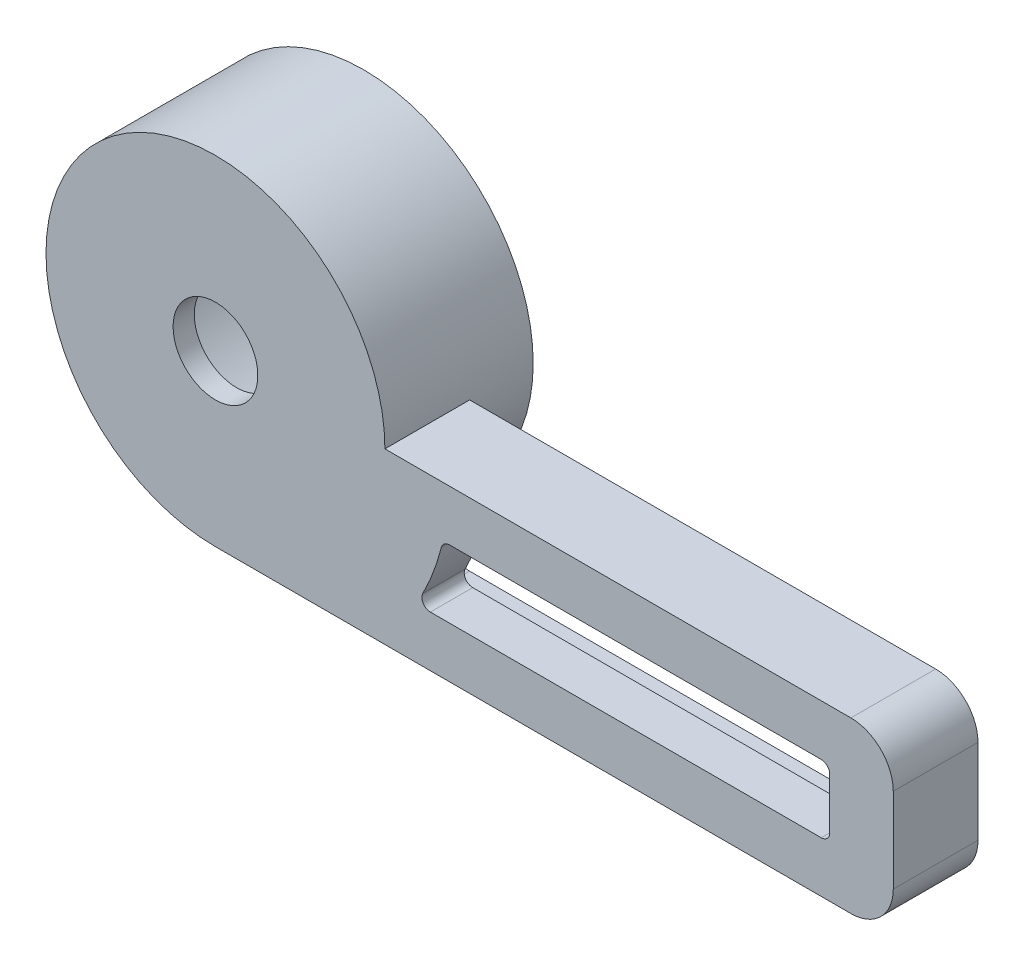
ISO-10303-21;
HEADER;
FILE_DESCRIPTION(('STEP AP214'),'2;1');
FILE_NAME('part.step','',(''),(''),'','','');
FILE_SCHEMA(('AUTOMOTIVE_DESIGN { 1 0 10303 214 1 1 1 1 }'));
ENDSEC;
DATA;
#1=APPLICATION_CONTEXT('core data for automotive mechanical design processes');
#2=APPLICATION_PROTOCOL_DEFINITION('international standard','automotive_design',2000,#1);
#3=PRODUCT_CONTEXT('',#1,'mechanical');
#4=PRODUCT('Part','Part','',(#3));
#5=PRODUCT_RELATED_PRODUCT_CATEGORY('part','',(#4));
#6=PRODUCT_DEFINITION_FORMATION('','',#4);
#7=PRODUCT_DEFINITION_CONTEXT('part definition',#1,'design');
#8=PRODUCT_DEFINITION('design','',#6,#7);
#9=PRODUCT_DEFINITION_SHAPE('','',#8);
#10=(LENGTH_UNIT() NAMED_UNIT(*) SI_UNIT(.MILLI.,.METRE.));
#11=(NAMED_UNIT(*) PLANE_ANGLE_UNIT() SI_UNIT($,.RADIAN.));
#12=(NAMED_UNIT(*) SI_UNIT($,.STERADIAN.) SOLID_ANGLE_UNIT());
#13=UNCERTAINTY_MEASURE_WITH_UNIT(LENGTH_MEASURE(1.E-05),#10,'distance_accuracy_value','');
#14=(GEOMETRIC_REPRESENTATION_CONTEXT(3) GLOBAL_UNCERTAINTY_ASSIGNED_CONTEXT((#13)) GLOBAL_UNIT_ASSIGNED_CONTEXT((#10,
#11,#12)) REPRESENTATION_CONTEXT('',''));
#15=CARTESIAN_POINT('',(0.,0.,0.));
#16=DIRECTION('',(0.,0.,1.));
#17=DIRECTION('',(1.,0.,0.));
#18=AXIS2_PLACEMENT_3D('',#15,#16,#17);
#19=CARTESIAN_POINT('',(-60.,20.,-20.));
#20=DIRECTION('',(0.,-1.,0.));
#21=DIRECTION('',(0.,0.,-1.));
#22=AXIS2_PLACEMENT_3D('',#19,#20,#21);
#23=PLANE('',#22);
#24=DIRECTION('',(1.,0.,0.));
#25=VECTOR('',#24,1.);
#26=CARTESIAN_POINT('',(-60.,20.,-20.));
#27=LINE('',#26,#25);
#28=CARTESIAN_POINT('',(-20.,20.,-20.));
#29=VERTEX_POINT('',#28);
#30=CARTESIAN_POINT('',(89.9999999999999,20.,-20.));
#31=VERTEX_POINT('',#30);
#32=EDGE_CURVE('E361',#29,#31,#27,.T.);
#33=ORIENTED_EDGE('',*,*,#32,.F.);
#34=DIRECTION('',(0.,0.,1.));
#35=VECTOR('',#34,1.);
#36=CARTESIAN_POINT('',(-20.,20.,-35.));
#37=LINE('',#36,#35);
#38=CARTESIAN_POINT('',(-20.,20.,0.));
#39=VERTEX_POINT('',#38);
#40=EDGE_CURVE('E337',#29,#39,#37,.T.);
#41=ORIENTED_EDGE('',*,*,#40,.T.);
#42=DIRECTION('',(1.,0.,0.));
#43=VECTOR('',#42,1.);
#44=CARTESIAN_POINT('',(-60.,20.,0.));
#45=LINE('',#44,#43);
#46=CARTESIAN_POINT('',(89.9999999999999,20.,0.));
#47=VERTEX_POINT('',#46);
#48=EDGE_CURVE('E349',#39,#47,#45,.T.);
#49=ORIENTED_EDGE('',*,*,#48,.T.);
#50=DIRECTION('',(0.,0.,1.));
#51=VECTOR('',#50,1.);
#52=CARTESIAN_POINT('',(89.9999999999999,20.,-20.));
#53=LINE('',#52,#51);
#54=EDGE_CURVE('E11',#31,#47,#53,.T.);
#55=ORIENTED_EDGE('',*,*,#54,.F.);
#56=EDGE_LOOP('',(#33,#41,#49,#55));
#57=FACE_BOUND('',#56,.T.);
#58=ADVANCED_FACE('F39',(#57),#23,.F.);
#59=CARTESIAN_POINT('',(90.,10.,-20.));
#60=DIRECTION('',(0.,0.,1.));
#61=DIRECTION('',(1.,0.,0.));
#62=AXIS2_PLACEMENT_3D('',#59,#60,#61);
#63=CYLINDRICAL_SURFACE('',#62,10.);
#64=CARTESIAN_POINT('',(90.,10.,0.));
#65=DIRECTION('',(0.,0.,-1.));
#66=DIRECTION('',(-1.,0.,0.));
#67=AXIS2_PLACEMENT_3D('',#64,#65,#66);
#68=CIRCLE('',#67,10.);
#69=CARTESIAN_POINT('',(100.,9.99999999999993,0.));
#70=VERTEX_POINT('',#69);
#71=EDGE_CURVE('E346',#47,#70,#68,.T.);
#72=ORIENTED_EDGE('',*,*,#71,.T.);
#73=DIRECTION('',(0.,0.,1.));
#74=VECTOR('',#73,1.);
#75=CARTESIAN_POINT('',(100.,9.99999999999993,-20.));
#76=LINE('',#75,#74);
#77=CARTESIAN_POINT('',(100.,9.99999999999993,-20.));
#78=VERTEX_POINT('',#77);
#79=EDGE_CURVE('E48',#78,#70,#76,.T.);
#80=ORIENTED_EDGE('',*,*,#79,.F.);
#81=CARTESIAN_POINT('',(90.,10.,-20.));
#82=DIRECTION('',(0.,0.,-1.));
#83=DIRECTION('',(-1.,0.,0.));
#84=AXIS2_PLACEMENT_3D('',#81,#82,#83);
#85=CIRCLE('',#84,10.);
#86=EDGE_CURVE('E359',#31,#78,#85,.T.);
#87=ORIENTED_EDGE('',*,*,#86,.F.);
#88=ORIENTED_EDGE('',*,*,#54,.T.);
#89=EDGE_LOOP('',(#72,#80,#87,#88));
#90=FACE_BOUND('',#89,.T.);
#91=ADVANCED_FACE('F386',(#90),#63,.T.);
#92=CARTESIAN_POINT('',(100.,-9.99999999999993,-20.));
#93=DIRECTION('',(1.,0.,0.));
#94=DIRECTION('',(0.,0.,-1.));
#95=AXIS2_PLACEMENT_3D('',#92,#93,#94);
#96=PLANE('',#95);
#97=DIRECTION('',(0.,1.,0.));
#98=VECTOR('',#97,1.);
#99=CARTESIAN_POINT('',(100.,-9.99999999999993,0.));
#100=LINE('',#99,#98);
#101=CARTESIAN_POINT('',(100.,-9.99999999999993,0.));
#102=VERTEX_POINT('',#101);
#103=EDGE_CURVE('E343',#102,#70,#100,.T.);
#104=ORIENTED_EDGE('',*,*,#103,.F.);
#105=DIRECTION('',(0.,0.,1.));
#106=VECTOR('',#105,1.);
#107=CARTESIAN_POINT('',(100.,-9.99999999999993,-20.));
#108=LINE('',#107,#106);
#109=CARTESIAN_POINT('',(100.,-9.99999999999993,-20.));
#110=VERTEX_POINT('',#109);
#111=EDGE_CURVE('E364',#110,#102,#108,.T.);
#112=ORIENTED_EDGE('',*,*,#111,.F.);
#113=DIRECTION('',(0.,1.,0.));
#114=VECTOR('',#113,1.);
#115=CARTESIAN_POINT('',(100.,-9.99999999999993,-20.));
#116=LINE('',#115,#114);
#117=EDGE_CURVE('E356',#110,#78,#116,.T.);
#118=ORIENTED_EDGE('',*,*,#117,.T.);
#119=ORIENTED_EDGE('',*,*,#79,.T.);
#120=EDGE_LOOP('',(#104,#112,#118,#119));
#121=FACE_BOUND('',#120,.T.);
#122=ADVANCED_FACE('F400',(#121),#96,.T.);
#123=CARTESIAN_POINT('',(90.,-10.,-20.));
#124=DIRECTION('',(0.,0.,1.));
#125=DIRECTION('',(1.,0.,0.));
#126=AXIS2_PLACEMENT_3D('',#123,#124,#125);
#127=CYLINDRICAL_SURFACE('',#126,10.);
#128=CARTESIAN_POINT('',(90.,-10.,0.));
#129=DIRECTION('',(0.,0.,-1.));
#130=DIRECTION('',(-1.,0.,0.));
#131=AXIS2_PLACEMENT_3D('',#128,#129,#130);
#132=CIRCLE('',#131,10.);
#133=CARTESIAN_POINT('',(89.9999999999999,-20.,0.));
#134=VERTEX_POINT('',#133);
#135=EDGE_CURVE('E341',#102,#134,#132,.T.);
#136=ORIENTED_EDGE('',*,*,#135,.T.);
#137=DIRECTION('',(0.,0.,1.));
#138=VECTOR('',#137,1.);
#139=CARTESIAN_POINT('',(89.9999999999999,-20.,-20.));
#140=LINE('',#139,#138);
#141=CARTESIAN_POINT('',(89.9999999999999,-20.,-20.));
#142=VERTEX_POINT('',#141);
#143=EDGE_CURVE('E365',#142,#134,#140,.T.);
#144=ORIENTED_EDGE('',*,*,#143,.F.);
#145=CARTESIAN_POINT('',(90.,-10.,-20.));
#146=DIRECTION('',(0.,0.,-1.));
#147=DIRECTION('',(-1.,0.,0.));
#148=AXIS2_PLACEMENT_3D('',#145,#146,#147);
#149=CIRCLE('',#148,10.);
#150=EDGE_CURVE('E354',#110,#142,#149,.T.);
#151=ORIENTED_EDGE('',*,*,#150,.F.);
#152=ORIENTED_EDGE('',*,*,#111,.T.);
#153=EDGE_LOOP('',(#136,#144,#151,#152));
#154=FACE_BOUND('',#153,.T.);
#155=ADVANCED_FACE('F393',(#154),#127,.T.);
#156=CARTESIAN_POINT('',(89.9999999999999,-20.,-20.));
#157=DIRECTION('',(0.,1.,0.));
#158=DIRECTION('',(0.,0.,1.));
#159=AXIS2_PLACEMENT_3D('',#156,#157,#158);
#160=PLANE('',#159);
#161=DIRECTION('',(-1.,0.,0.));
#162=VECTOR('',#161,1.);
#163=CARTESIAN_POINT('',(89.9999999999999,-20.,0.));
#164=LINE('',#163,#162);
#165=CARTESIAN_POINT('',(-60.,-20.,0.));
#166=VERTEX_POINT('',#165);
#167=EDGE_CURVE('E339',#134,#166,#164,.T.);
#168=ORIENTED_EDGE('',*,*,#167,.T.);
#169=DIRECTION('',(0.,0.,1.));
#170=VECTOR('',#169,1.);
#171=CARTESIAN_POINT('',(-60.,-20.,-20.));
#172=LINE('',#171,#170);
#173=CARTESIAN_POINT('',(-60.,-20.,-20.));
#174=VERTEX_POINT('',#173);
#175=EDGE_CURVE('E43',#174,#166,#172,.T.);
#176=ORIENTED_EDGE('',*,*,#175,.F.);
#177=DIRECTION('',(-1.,0.,0.));
#178=VECTOR('',#177,1.);
#179=CARTESIAN_POINT('',(89.9999999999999,-20.,-20.));
#180=LINE('',#179,#178);
#181=EDGE_CURVE('E351',#142,#174,#180,.T.);
#182=ORIENTED_EDGE('',*,*,#181,.F.);
#183=ORIENTED_EDGE('',*,*,#143,.T.);
#184=EDGE_LOOP('',(#168,#176,#182,#183));
#185=FACE_BOUND('',#184,.T.);
#186=ADVANCED_FACE('F41',(#185),#160,.F.);
#187=CARTESIAN_POINT('',(90.,-10.,-20.));
#188=DIRECTION('',(0.,0.,-1.));
#189=DIRECTION('',(-1.,0.,0.));
#190=AXIS2_PLACEMENT_3D('',#187,#188,#189);
#191=PLANE('',#190);
#192=CARTESIAN_POINT('',(90.,-10.,-20.));
#193=DIRECTION('',(0.,0.,-1.));
#194=DIRECTION('',(-1.,0.,0.));
#195=AXIS2_PLACEMENT_3D('',#192,#193,#194);
#196=CIRCLE('',#195,4.99999999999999);
#197=CARTESIAN_POINT('',(95.,-9.99999999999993,-20.));
#198=VERTEX_POINT('',#197);
#199=CARTESIAN_POINT('',(90.,-15.,-20.));
#200=VERTEX_POINT('',#199);
#201=EDGE_CURVE('E261',#198,#200,#196,.T.);
#202=ORIENTED_EDGE('',*,*,#201,.F.);
#203=DIRECTION('',(0.,1.,0.));
#204=VECTOR('',#203,1.);
#205=CARTESIAN_POINT('',(95.,-9.99999999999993,-20.));
#206=LINE('',#205,#204);
#207=CARTESIAN_POINT('',(95.,9.99999999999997,-20.));
#208=VERTEX_POINT('',#207);
#209=EDGE_CURVE('E281',#198,#208,#206,.T.);
#210=ORIENTED_EDGE('',*,*,#209,.T.);
#211=CARTESIAN_POINT('',(90.,10.,-20.));
#212=DIRECTION('',(0.,0.,-1.));
#213=DIRECTION('',(-1.,0.,0.));
#214=AXIS2_PLACEMENT_3D('',#211,#212,#213);
#215=CIRCLE('',#214,4.99999999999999);
#216=CARTESIAN_POINT('',(89.9999999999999,15.,-20.));
#217=VERTEX_POINT('',#216);
#218=EDGE_CURVE('E278',#217,#208,#215,.T.);
#219=ORIENTED_EDGE('',*,*,#218,.F.);
#220=DIRECTION('',(1.,0.,0.));
#221=VECTOR('',#220,1.);
#222=CARTESIAN_POINT('',(-11.0102051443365,15.,-20.));
#223=LINE('',#222,#221);
#224=CARTESIAN_POINT('',(-11.0102051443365,15.,-20.));
#225=VERTEX_POINT('',#224);
#226=EDGE_CURVE('E275',#225,#217,#223,.T.);
#227=ORIENTED_EDGE('',*,*,#226,.F.);
#228=CARTESIAN_POINT('',(-11.0102051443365,10.,-20.));
#229=DIRECTION('',(0.,0.,1.));
#230=DIRECTION('',(1.,0.,0.));
#231=AXIS2_PLACEMENT_3D('',#228,#229,#230);
#232=CIRCLE('',#231,5.);
#233=CARTESIAN_POINT('',(-15.9091846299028,11.,-20.));
#234=VERTEX_POINT('',#233);
#235=EDGE_CURVE('E272',#225,#234,#232,.T.);
#236=ORIENTED_EDGE('',*,*,#235,.T.);
#237=CARTESIAN_POINT('',(-60.,20.,-20.));
#238=DIRECTION('',(0.,0.,-1.));
#239=DIRECTION('',(-1.,0.,0.));
#240=AXIS2_PLACEMENT_3D('',#237,#238,#239);
#241=CIRCLE('',#240,45.);
#242=CARTESIAN_POINT('',(-24.,-7.,-20.));
#243=VERTEX_POINT('',#242);
#244=EDGE_CURVE('E269',#234,#243,#241,.T.);
#245=ORIENTED_EDGE('',*,*,#244,.T.);
#246=CARTESIAN_POINT('',(-20.,-10.,-20.));
#247=DIRECTION('',(0.,0.,1.));
#248=DIRECTION('',(1.,0.,0.));
#249=AXIS2_PLACEMENT_3D('',#246,#247,#248);
#250=CIRCLE('',#249,5.00000000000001);
#251=CARTESIAN_POINT('',(-20.,-15.,-20.));
#252=VERTEX_POINT('',#251);
#253=EDGE_CURVE('E266',#243,#252,#250,.T.);
#254=ORIENTED_EDGE('',*,*,#253,.T.);
#255=DIRECTION('',(-1.,0.,0.));
#256=VECTOR('',#255,1.);
#257=CARTESIAN_POINT('',(90.,-15.,-20.));
#258=LINE('',#257,#256);
#259=EDGE_CURVE('E263',#200,#252,#258,.T.);
#260=ORIENTED_EDGE('',*,*,#259,.F.);
#261=EDGE_LOOP('',(#202,#210,#219,#227,#236,#245,#254,#260));
#262=FACE_BOUND('',#261,.T.);
#263=CARTESIAN_POINT('',(-60.,20.,-20.));
#264=DIRECTION('',(0.,0.,-1.));
#265=DIRECTION('',(-1.,0.,0.));
#266=AXIS2_PLACEMENT_3D('',#263,#264,#265);
#267=CIRCLE('',#266,40.);
#268=EDGE_CURVE('E334',#29,#174,#267,.T.);
#269=ORIENTED_EDGE('',*,*,#268,.F.);
#270=ORIENTED_EDGE('',*,*,#32,.T.);
#271=ORIENTED_EDGE('',*,*,#86,.T.);
#272=ORIENTED_EDGE('',*,*,#117,.F.);
#273=ORIENTED_EDGE('',*,*,#150,.T.);
#274=ORIENTED_EDGE('',*,*,#181,.T.);
#275=EDGE_LOOP('',(#269,#270,#271,#272,#273,#274));
#276=FACE_BOUND('',#275,.T.);
#277=ADVANCED_FACE('F390',(#262,#276),#191,.T.);
#278=CARTESIAN_POINT('',(90.,-10.,0.));
#279=DIRECTION('',(0.,0.,-1.));
#280=DIRECTION('',(-1.,0.,0.));
#281=AXIS2_PLACEMENT_3D('',#278,#279,#280);
#282=PLANE('',#281);
#283=DIRECTION('',(0.,1.,0.));
#284=VECTOR('',#283,1.);
#285=CARTESIAN_POINT('',(85.,-5.99999999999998,0.));
#286=LINE('',#285,#284);
#287=CARTESIAN_POINT('',(85.,-5.99999999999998,0.));
#288=VERTEX_POINT('',#287);
#289=CARTESIAN_POINT('',(85.,5.99999999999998,0.));
#290=VERTEX_POINT('',#289);
#291=EDGE_CURVE('E241',#288,#290,#286,.T.);
#292=ORIENTED_EDGE('',*,*,#291,.F.);
#293=CARTESIAN_POINT('',(83.,-6.,0.));
#294=DIRECTION('',(0.,0.,-1.));
#295=DIRECTION('',(-1.,0.,0.));
#296=AXIS2_PLACEMENT_3D('',#293,#294,#295);
#297=CIRCLE('',#296,2.);
#298=CARTESIAN_POINT('',(83.,-8.,0.));
#299=VERTEX_POINT('',#298);
#300=EDGE_CURVE('E226',#288,#299,#297,.T.);
#301=ORIENTED_EDGE('',*,*,#300,.T.);
#302=DIRECTION('',(-1.,0.,0.));
#303=VECTOR('',#302,1.);
#304=CARTESIAN_POINT('',(83.,-8.,0.));
#305=LINE('',#304,#303);
#306=CARTESIAN_POINT('',(-9.27525258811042,-8.,0.));
#307=VERTEX_POINT('',#306);
#308=EDGE_CURVE('E229',#299,#307,#305,.T.);
#309=ORIENTED_EDGE('',*,*,#308,.T.);
#310=CARTESIAN_POINT('',(-9.27525258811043,-6.,0.));
#311=DIRECTION('',(0.,0.,1.));
#312=DIRECTION('',(1.,0.,0.));
#313=AXIS2_PLACEMENT_3D('',#310,#311,#312);
#314=CIRCLE('',#313,2.);
#315=CARTESIAN_POINT('',(-11.0550682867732,-5.0877192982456,0.));
#316=VERTEX_POINT('',#315);
#317=EDGE_CURVE('E196',#316,#307,#314,.T.);
#318=ORIENTED_EDGE('',*,*,#317,.F.);
#319=CARTESIAN_POINT('',(-60.,20.,0.));
#320=DIRECTION('',(0.,0.,-1.));
#321=DIRECTION('',(-1.,0.,0.));
#322=AXIS2_PLACEMENT_3D('',#319,#320,#321);
#323=CIRCLE('',#322,55.);
#324=CARTESIAN_POINT('',(-6.68477627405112,6.49122807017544,0.));
#325=VERTEX_POINT('',#324);
#326=EDGE_CURVE('E232',#325,#316,#323,.T.);
#327=ORIENTED_EDGE('',*,*,#326,.F.);
#328=CARTESIAN_POINT('',(-4.7460408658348,6.,0.));
#329=DIRECTION('',(0.,0.,1.));
#330=DIRECTION('',(1.,0.,0.));
#331=AXIS2_PLACEMENT_3D('',#328,#329,#330);
#332=CIRCLE('',#331,2.);
#333=CARTESIAN_POINT('',(-4.7460408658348,8.,0.));
#334=VERTEX_POINT('',#333);
#335=EDGE_CURVE('E234',#334,#325,#332,.T.);
#336=ORIENTED_EDGE('',*,*,#335,.F.);
#337=DIRECTION('',(1.,0.,0.));
#338=VECTOR('',#337,1.);
#339=CARTESIAN_POINT('',(-4.7460408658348,8.,0.));
#340=LINE('',#339,#338);
#341=CARTESIAN_POINT('',(83.,8.,0.));
#342=VERTEX_POINT('',#341);
#343=EDGE_CURVE('E236',#334,#342,#340,.T.);
#344=ORIENTED_EDGE('',*,*,#343,.T.);
#345=CARTESIAN_POINT('',(83.,6.,0.));
#346=DIRECTION('',(0.,0.,1.));
#347=DIRECTION('',(1.,0.,0.));
#348=AXIS2_PLACEMENT_3D('',#345,#346,#347);
#349=CIRCLE('',#348,2.);
#350=EDGE_CURVE('E239',#290,#342,#349,.T.);
#351=ORIENTED_EDGE('',*,*,#350,.F.);
#352=EDGE_LOOP('',(#292,#301,#309,#318,#327,#336,#344,#351));
#353=FACE_BOUND('',#352,.T.);
#354=CARTESIAN_POINT('',(-60.,20.,0.));
#355=DIRECTION('',(0.,0.,-1.));
#356=DIRECTION('',(-1.,0.,0.));
#357=AXIS2_PLACEMENT_3D('',#354,#355,#356);
#358=CIRCLE('',#357,10.);
#359=CARTESIAN_POINT('',(-70.,20.,0.));
#360=VERTEX_POINT('',#359);
#361=EDGE_CURVE('E258',#360,#360,#358,.T.);
#362=ORIENTED_EDGE('',*,*,#361,.T.);
#363=EDGE_LOOP('',(#362));
#364=FACE_BOUND('',#363,.T.);
#365=CARTESIAN_POINT('',(-60.,20.,0.));
#366=DIRECTION('',(0.,0.,1.));
#367=DIRECTION('',(1.,0.,0.));
#368=AXIS2_PLACEMENT_3D('',#365,#366,#367);
#369=CIRCLE('',#368,40.);
#370=EDGE_CURVE('E328',#39,#166,#369,.T.);
#371=ORIENTED_EDGE('',*,*,#370,.T.);
#372=ORIENTED_EDGE('',*,*,#167,.F.);
#373=ORIENTED_EDGE('',*,*,#135,.F.);
#374=ORIENTED_EDGE('',*,*,#103,.T.);
#375=ORIENTED_EDGE('',*,*,#71,.F.);
#376=ORIENTED_EDGE('',*,*,#48,.F.);
#377=EDGE_LOOP('',(#371,#372,#373,#374,#375,#376));
#378=FACE_BOUND('',#377,.T.);
#379=ADVANCED_FACE('F378',(#353,#364,#378),#282,.F.);
#380=CARTESIAN_POINT('',(-60.,20.,-35.));
#381=DIRECTION('',(0.,0.,1.));
#382=DIRECTION('',(1.,0.,0.));
#383=AXIS2_PLACEMENT_3D('',#380,#381,#382);
#384=CYLINDRICAL_SURFACE('',#383,40.);
#385=CARTESIAN_POINT('',(-60.,20.,-35.));
#386=DIRECTION('',(0.,0.,1.));
#387=DIRECTION('',(1.,0.,0.));
#388=AXIS2_PLACEMENT_3D('',#385,#386,#387);
#389=CIRCLE('',#388,40.);
#390=CARTESIAN_POINT('',(-20.,20.,-35.));
#391=VERTEX_POINT('',#390);
#392=EDGE_CURVE('E331',#391,#391,#389,.T.);
#393=ORIENTED_EDGE('',*,*,#392,.T.);
#394=EDGE_LOOP('',(#393));
#395=FACE_BOUND('',#394,.T.);
#396=ORIENTED_EDGE('',*,*,#40,.F.);
#397=ORIENTED_EDGE('',*,*,#268,.T.);
#398=ORIENTED_EDGE('',*,*,#175,.T.);
#399=ORIENTED_EDGE('',*,*,#370,.F.);
#400=EDGE_LOOP('',(#396,#397,#398,#399));
#401=FACE_BOUND('',#400,.T.);
#402=ADVANCED_FACE('F375',(#395,#401),#384,.T.);
#403=CARTESIAN_POINT('',(-60.,20.,-35.));
#404=DIRECTION('',(0.,0.,1.));
#405=DIRECTION('',(1.,0.,0.));
#406=AXIS2_PLACEMENT_3D('',#403,#404,#405);
#407=PLANE('',#406);
#408=CARTESIAN_POINT('',(-60.,20.,-35.));
#409=DIRECTION('',(0.,0.,-1.));
#410=DIRECTION('',(-1.,0.,0.));
#411=AXIS2_PLACEMENT_3D('',#408,#409,#410);
#412=CIRCLE('',#411,35.);
#413=CARTESIAN_POINT('',(-95.,20.,-35.));
#414=VERTEX_POINT('',#413);
#415=EDGE_CURVE('E307',#414,#414,#412,.T.);
#416=ORIENTED_EDGE('',*,*,#415,.F.);
#417=EDGE_LOOP('',(#416));
#418=FACE_BOUND('',#417,.T.);
#419=ORIENTED_EDGE('',*,*,#392,.F.);
#420=EDGE_LOOP('',(#419));
#421=FACE_BOUND('',#420,.T.);
#422=ADVANCED_FACE('F435',(#418,#421),#407,.F.);
#423=CARTESIAN_POINT('',(-60.,20.,-5.));
#424=DIRECTION('',(0.,0.,-1.));
#425=DIRECTION('',(-1.,0.,0.));
#426=AXIS2_PLACEMENT_3D('',#423,#424,#425);
#427=CYLINDRICAL_SURFACE('',#426,35.);
#428=CARTESIAN_POINT('',(-60.,20.,-5.));
#429=DIRECTION('',(0.,0.,-1.));
#430=DIRECTION('',(-1.,0.,0.));
#431=AXIS2_PLACEMENT_3D('',#428,#429,#430);
#432=CIRCLE('',#431,35.);
#433=CARTESIAN_POINT('',(-95.,20.,-5.));
#434=VERTEX_POINT('',#433);
#435=EDGE_CURVE('E325',#434,#434,#432,.T.);
#436=ORIENTED_EDGE('',*,*,#435,.F.);
#437=EDGE_LOOP('',(#436));
#438=FACE_BOUND('',#437,.T.);
#439=ORIENTED_EDGE('',*,*,#415,.T.);
#440=EDGE_LOOP('',(#439));
#441=FACE_BOUND('',#440,.T.);
#442=ADVANCED_FACE('F697',(#438,#441),#427,.F.);
#443=CARTESIAN_POINT('',(-60.,20.,-5.));
#444=DIRECTION('',(0.,0.,-1.));
#445=DIRECTION('',(-1.,0.,0.));
#446=AXIS2_PLACEMENT_3D('',#443,#444,#445);
#447=PLANE('',#446);
#448=CARTESIAN_POINT('',(-60.,20.,-5.));
#449=DIRECTION('',(0.,0.,-1.));
#450=DIRECTION('',(-1.,0.,0.));
#451=AXIS2_PLACEMENT_3D('',#448,#449,#450);
#452=CIRCLE('',#451,10.);
#453=CARTESIAN_POINT('',(-70.,20.,-5.));
#454=VERTEX_POINT('',#453);
#455=EDGE_CURVE('E245',#454,#454,#452,.T.);
#456=ORIENTED_EDGE('',*,*,#455,.F.);
#457=EDGE_LOOP('',(#456));
#458=FACE_BOUND('',#457,.T.);
#459=ORIENTED_EDGE('',*,*,#435,.T.);
#460=EDGE_LOOP('',(#459));
#461=FACE_BOUND('',#460,.T.);
#462=ADVANCED_FACE('F451',(#458,#461),#447,.T.);
#463=CARTESIAN_POINT('',(90.,-10.,-10.));
#464=DIRECTION('',(0.,0.,-1.));
#465=DIRECTION('',(-1.,0.,0.));
#466=AXIS2_PLACEMENT_3D('',#463,#464,#465);
#467=CYLINDRICAL_SURFACE('',#466,4.99999999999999);
#468=ORIENTED_EDGE('',*,*,#201,.T.);
#469=DIRECTION('',(0.,0.,-1.));
#470=VECTOR('',#469,1.);
#471=CARTESIAN_POINT('',(90.,-15.,-10.));
#472=LINE('',#471,#470);
#473=CARTESIAN_POINT('',(90.,-15.,-10.));
#474=VERTEX_POINT('',#473);
#475=EDGE_CURVE('E304',#474,#200,#472,.T.);
#476=ORIENTED_EDGE('',*,*,#475,.F.);
#477=CARTESIAN_POINT('',(90.,-10.,-10.));
#478=DIRECTION('',(0.,0.,-1.));
#479=DIRECTION('',(-1.,0.,0.));
#480=AXIS2_PLACEMENT_3D('',#477,#478,#479);
#481=CIRCLE('',#480,4.99999999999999);
#482=CARTESIAN_POINT('',(95.,-9.99999999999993,-10.));
#483=VERTEX_POINT('',#482);
#484=EDGE_CURVE('E284',#483,#474,#481,.T.);
#485=ORIENTED_EDGE('',*,*,#484,.F.);
#486=DIRECTION('',(0.,0.,-1.));
#487=VECTOR('',#486,1.);
#488=CARTESIAN_POINT('',(95.,-9.99999999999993,-10.));
#489=LINE('',#488,#487);
#490=EDGE_CURVE('E305',#483,#198,#489,.T.);
#491=ORIENTED_EDGE('',*,*,#490,.T.);
#492=EDGE_LOOP('',(#468,#476,#485,#491));
#493=FACE_BOUND('',#492,.T.);
#494=ADVANCED_FACE('F445',(#493),#467,.F.);
#495=CARTESIAN_POINT('',(95.,-9.99999999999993,-10.));
#496=DIRECTION('',(-1.,0.,0.));
#497=DIRECTION('',(0.,0.,1.));
#498=AXIS2_PLACEMENT_3D('',#495,#496,#497);
#499=PLANE('',#498);
#500=ORIENTED_EDGE('',*,*,#209,.F.);
#501=ORIENTED_EDGE('',*,*,#490,.F.);
#502=DIRECTION('',(0.,1.,0.));
#503=VECTOR('',#502,1.);
#504=CARTESIAN_POINT('',(95.,-9.99999999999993,-10.));
#505=LINE('',#504,#503);
#506=CARTESIAN_POINT('',(95.,9.99999999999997,-10.));
#507=VERTEX_POINT('',#506);
#508=EDGE_CURVE('E302',#483,#507,#505,.T.);
#509=ORIENTED_EDGE('',*,*,#508,.T.);
#510=DIRECTION('',(0.,0.,-1.));
#511=VECTOR('',#510,1.);
#512=CARTESIAN_POINT('',(95.,9.99999999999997,-10.));
#513=LINE('',#512,#511);
#514=EDGE_CURVE('E308',#507,#208,#513,.T.);
#515=ORIENTED_EDGE('',*,*,#514,.T.);
#516=EDGE_LOOP('',(#500,#501,#509,#515));
#517=FACE_BOUND('',#516,.T.);
#518=ADVANCED_FACE('F450',(#517),#499,.T.);
#519=CARTESIAN_POINT('',(90.,10.,-10.));
#520=DIRECTION('',(0.,0.,-1.));
#521=DIRECTION('',(-1.,0.,0.));
#522=AXIS2_PLACEMENT_3D('',#519,#520,#521);
#523=CYLINDRICAL_SURFACE('',#522,4.99999999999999);
#524=ORIENTED_EDGE('',*,*,#218,.T.);
#525=ORIENTED_EDGE('',*,*,#514,.F.);
#526=CARTESIAN_POINT('',(90.,10.,-10.));
#527=DIRECTION('',(0.,0.,-1.));
#528=DIRECTION('',(-1.,0.,0.));
#529=AXIS2_PLACEMENT_3D('',#526,#527,#528);
#530=CIRCLE('',#529,4.99999999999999);
#531=CARTESIAN_POINT('',(89.9999999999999,15.,-10.));
#532=VERTEX_POINT('',#531);
#533=EDGE_CURVE('E299',#532,#507,#530,.T.);
#534=ORIENTED_EDGE('',*,*,#533,.F.);
#535=DIRECTION('',(0.,0.,-1.));
#536=VECTOR('',#535,1.);
#537=CARTESIAN_POINT('',(89.9999999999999,15.,-10.));
#538=LINE('',#537,#536);
#539=EDGE_CURVE('E310',#532,#217,#538,.T.);
#540=ORIENTED_EDGE('',*,*,#539,.T.);
#541=EDGE_LOOP('',(#524,#525,#534,#540));
#542=FACE_BOUND('',#541,.T.);
#543=ADVANCED_FACE('F463',(#542),#523,.F.);
#544=CARTESIAN_POINT('',(-11.0102051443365,15.,-10.));
#545=DIRECTION('',(0.,1.,0.));
#546=DIRECTION('',(0.,0.,1.));
#547=AXIS2_PLACEMENT_3D('',#544,#545,#546);
#548=PLANE('',#547);
#549=ORIENTED_EDGE('',*,*,#226,.T.);
#550=ORIENTED_EDGE('',*,*,#539,.F.);
#551=DIRECTION('',(1.,0.,0.));
#552=VECTOR('',#551,1.);
#553=CARTESIAN_POINT('',(-11.0102051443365,15.,-10.));
#554=LINE('',#553,#552);
#555=CARTESIAN_POINT('',(-11.0102051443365,15.,-10.));
#556=VERTEX_POINT('',#555);
#557=EDGE_CURVE('E296',#556,#532,#554,.T.);
#558=ORIENTED_EDGE('',*,*,#557,.F.);
#559=DIRECTION('',(0.,0.,-1.));
#560=VECTOR('',#559,1.);
#561=CARTESIAN_POINT('',(-11.0102051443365,15.,-10.));
#562=LINE('',#561,#560);
#563=EDGE_CURVE('E312',#556,#225,#562,.T.);
#564=ORIENTED_EDGE('',*,*,#563,.T.);
#565=EDGE_LOOP('',(#549,#550,#558,#564));
#566=FACE_BOUND('',#565,.T.);
#567=ADVANCED_FACE('F473',(#566),#548,.F.);
#568=CARTESIAN_POINT('',(-11.0102051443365,10.,-10.));
#569=DIRECTION('',(0.,0.,-1.));
#570=DIRECTION('',(-1.,0.,0.));
#571=AXIS2_PLACEMENT_3D('',#568,#569,#570);
#572=CYLINDRICAL_SURFACE('',#571,5.);
#573=ORIENTED_EDGE('',*,*,#235,.F.);
#574=ORIENTED_EDGE('',*,*,#563,.F.);
#575=CARTESIAN_POINT('',(-11.0102051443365,10.,-10.));
#576=DIRECTION('',(0.,0.,1.));
#577=DIRECTION('',(1.,0.,0.));
#578=AXIS2_PLACEMENT_3D('',#575,#576,#577);
#579=CIRCLE('',#578,5.);
#580=CARTESIAN_POINT('',(-15.9091846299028,11.,-10.));
#581=VERTEX_POINT('',#580);
#582=EDGE_CURVE('E294',#556,#581,#579,.T.);
#583=ORIENTED_EDGE('',*,*,#582,.T.);
#584=DIRECTION('',(0.,0.,-1.));
#585=VECTOR('',#584,1.);
#586=CARTESIAN_POINT('',(-15.9091846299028,11.,-10.));
#587=LINE('',#586,#585);
#588=EDGE_CURVE('E314',#581,#234,#587,.T.);
#589=ORIENTED_EDGE('',*,*,#588,.T.);
#590=EDGE_LOOP('',(#573,#574,#583,#589));
#591=FACE_BOUND('',#590,.T.);
#592=ADVANCED_FACE('F483',(#591),#572,.F.);
#593=CARTESIAN_POINT('',(-60.,20.,-10.));
#594=DIRECTION('',(0.,0.,-1.));
#595=DIRECTION('',(-1.,0.,0.));
#596=AXIS2_PLACEMENT_3D('',#593,#594,#595);
#597=CYLINDRICAL_SURFACE('',#596,45.);
#598=ORIENTED_EDGE('',*,*,#244,.F.);
#599=ORIENTED_EDGE('',*,*,#588,.F.);
#600=CARTESIAN_POINT('',(-60.,20.,-10.));
#601=DIRECTION('',(0.,0.,-1.));
#602=DIRECTION('',(-1.,0.,0.));
#603=AXIS2_PLACEMENT_3D('',#600,#601,#602);
#604=CIRCLE('',#603,45.);
#605=CARTESIAN_POINT('',(-24.,-7.,-10.));
#606=VERTEX_POINT('',#605);
#607=EDGE_CURVE('E292',#581,#606,#604,.T.);
#608=ORIENTED_EDGE('',*,*,#607,.T.);
#609=DIRECTION('',(0.,0.,-1.));
#610=VECTOR('',#609,1.);
#611=CARTESIAN_POINT('',(-24.,-7.,-10.));
#612=LINE('',#611,#610);
#613=EDGE_CURVE('E316',#606,#243,#612,.T.);
#614=ORIENTED_EDGE('',*,*,#613,.T.);
#615=EDGE_LOOP('',(#598,#599,#608,#614));
#616=FACE_BOUND('',#615,.T.);
#617=ADVANCED_FACE('F493',(#616),#597,.T.);
#618=CARTESIAN_POINT('',(-20.,-10.,-10.));
#619=DIRECTION('',(0.,0.,-1.));
#620=DIRECTION('',(-1.,0.,0.));
#621=AXIS2_PLACEMENT_3D('',#618,#619,#620);
#622=CYLINDRICAL_SURFACE('',#621,5.00000000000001);
#623=ORIENTED_EDGE('',*,*,#253,.F.);
#624=ORIENTED_EDGE('',*,*,#613,.F.);
#625=CARTESIAN_POINT('',(-20.,-10.,-10.));
#626=DIRECTION('',(0.,0.,1.));
#627=DIRECTION('',(1.,0.,0.));
#628=AXIS2_PLACEMENT_3D('',#625,#626,#627);
#629=CIRCLE('',#628,5.00000000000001);
#630=CARTESIAN_POINT('',(-20.,-15.,-10.));
#631=VERTEX_POINT('',#630);
#632=EDGE_CURVE('E290',#606,#631,#629,.T.);
#633=ORIENTED_EDGE('',*,*,#632,.T.);
#634=DIRECTION('',(0.,0.,-1.));
#635=VECTOR('',#634,1.);
#636=CARTESIAN_POINT('',(-20.,-15.,-10.));
#637=LINE('',#636,#635);
#638=EDGE_CURVE('E318',#631,#252,#637,.T.);
#639=ORIENTED_EDGE('',*,*,#638,.T.);
#640=EDGE_LOOP('',(#623,#624,#633,#639));
#641=FACE_BOUND('',#640,.T.);
#642=ADVANCED_FACE('F503',(#641),#622,.F.);
#643=CARTESIAN_POINT('',(90.,-15.,-10.));
#644=DIRECTION('',(0.,-1.,0.));
#645=DIRECTION('',(1.,0.,0.));
#646=AXIS2_PLACEMENT_3D('',#643,#644,#645);
#647=PLANE('',#646);
#648=ORIENTED_EDGE('',*,*,#259,.T.);
#649=ORIENTED_EDGE('',*,*,#638,.F.);
#650=DIRECTION('',(-1.,0.,0.));
#651=VECTOR('',#650,1.);
#652=CARTESIAN_POINT('',(90.,-15.,-10.));
#653=LINE('',#652,#651);
#654=EDGE_CURVE('E287',#474,#631,#653,.T.);
#655=ORIENTED_EDGE('',*,*,#654,.F.);
#656=ORIENTED_EDGE('',*,*,#475,.T.);
#657=EDGE_LOOP('',(#648,#649,#655,#656));
#658=FACE_BOUND('',#657,.T.);
#659=ADVANCED_FACE('F513',(#658),#647,.F.);
#660=CARTESIAN_POINT('',(90.,-10.,-10.));
#661=DIRECTION('',(0.,0.,-1.));
#662=DIRECTION('',(-1.,0.,0.));
#663=AXIS2_PLACEMENT_3D('',#660,#661,#662);
#664=PLANE('',#663);
#665=CARTESIAN_POINT('',(83.,-6.,-10.));
#666=DIRECTION('',(0.,0.,-1.));
#667=DIRECTION('',(-1.,0.,0.));
#668=AXIS2_PLACEMENT_3D('',#665,#666,#667);
#669=CIRCLE('',#668,2.);
#670=CARTESIAN_POINT('',(85.,-5.99999999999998,-10.));
#671=VERTEX_POINT('',#670);
#672=CARTESIAN_POINT('',(83.,-8.,-10.));
#673=VERTEX_POINT('',#672);
#674=EDGE_CURVE('E64',#671,#673,#669,.T.);
#675=ORIENTED_EDGE('',*,*,#674,.F.);
#676=DIRECTION('',(0.,1.,0.));
#677=VECTOR('',#676,1.);
#678=CARTESIAN_POINT('',(85.,-5.99999999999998,-10.));
#679=LINE('',#678,#677);
#680=CARTESIAN_POINT('',(85.,5.99999999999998,-10.));
#681=VERTEX_POINT('',#680);
#682=EDGE_CURVE('E223',#671,#681,#679,.T.);
#683=ORIENTED_EDGE('',*,*,#682,.T.);
#684=CARTESIAN_POINT('',(83.,6.,-10.));
#685=DIRECTION('',(0.,0.,1.));
#686=DIRECTION('',(1.,0.,0.));
#687=AXIS2_PLACEMENT_3D('',#684,#685,#686);
#688=CIRCLE('',#687,2.);
#689=CARTESIAN_POINT('',(83.,8.,-10.));
#690=VERTEX_POINT('',#689);
#691=EDGE_CURVE('E220',#681,#690,#688,.T.);
#692=ORIENTED_EDGE('',*,*,#691,.T.);
#693=DIRECTION('',(1.,0.,0.));
#694=VECTOR('',#693,1.);
#695=CARTESIAN_POINT('',(-4.7460408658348,8.,-10.));
#696=LINE('',#695,#694);
#697=CARTESIAN_POINT('',(-4.7460408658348,8.,-10.));
#698=VERTEX_POINT('',#697);
#699=EDGE_CURVE('E217',#698,#690,#696,.T.);
#700=ORIENTED_EDGE('',*,*,#699,.F.);
#701=CARTESIAN_POINT('',(-4.7460408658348,6.,-10.));
#702=DIRECTION('',(0.,0.,1.));
#703=DIRECTION('',(1.,0.,0.));
#704=AXIS2_PLACEMENT_3D('',#701,#702,#703);
#705=CIRCLE('',#704,2.);
#706=CARTESIAN_POINT('',(-6.68477627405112,6.49122807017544,-10.));
#707=VERTEX_POINT('',#706);
#708=EDGE_CURVE('E212',#698,#707,#705,.T.);
#709=ORIENTED_EDGE('',*,*,#708,.T.);
#710=CARTESIAN_POINT('',(-60.,20.,-10.));
#711=DIRECTION('',(0.,0.,-1.));
#712=DIRECTION('',(-1.,0.,0.));
#713=AXIS2_PLACEMENT_3D('',#710,#711,#712);
#714=CIRCLE('',#713,55.);
#715=CARTESIAN_POINT('',(-11.0550682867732,-5.0877192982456,-10.));
#716=VERTEX_POINT('',#715);
#717=EDGE_CURVE('E210',#707,#716,#714,.T.);
#718=ORIENTED_EDGE('',*,*,#717,.T.);
#719=CARTESIAN_POINT('',(-9.27525258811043,-6.,-10.));
#720=DIRECTION('',(0.,0.,1.));
#721=DIRECTION('',(1.,0.,0.));
#722=AXIS2_PLACEMENT_3D('',#719,#720,#721);
#723=CIRCLE('',#722,2.);
#724=CARTESIAN_POINT('',(-9.27525258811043,-8.,-10.));
#725=VERTEX_POINT('',#724);
#726=EDGE_CURVE('E193',#716,#725,#723,.T.);
#727=ORIENTED_EDGE('',*,*,#726,.T.);
#728=DIRECTION('',(-1.,0.,0.));
#729=VECTOR('',#728,1.);
#730=CARTESIAN_POINT('',(83.,-8.,-10.));
#731=LINE('',#730,#729);
#732=EDGE_CURVE('E202',#673,#725,#731,.T.);
#733=ORIENTED_EDGE('',*,*,#732,.F.);
#734=EDGE_LOOP('',(#675,#683,#692,#700,#709,#718,#727,#733));
#735=FACE_BOUND('',#734,.T.);
#736=ORIENTED_EDGE('',*,*,#484,.T.);
#737=ORIENTED_EDGE('',*,*,#654,.T.);
#738=ORIENTED_EDGE('',*,*,#632,.F.);
#739=ORIENTED_EDGE('',*,*,#607,.F.);
#740=ORIENTED_EDGE('',*,*,#582,.F.);
#741=ORIENTED_EDGE('',*,*,#557,.T.);
#742=ORIENTED_EDGE('',*,*,#533,.T.);
#743=ORIENTED_EDGE('',*,*,#508,.F.);
#744=EDGE_LOOP('',(#736,#737,#738,#739,#740,#741,#742,#743));
#745=FACE_BOUND('',#744,.T.);
#746=ADVANCED_FACE('F206',(#735,#745),#664,.T.);
#747=CARTESIAN_POINT('',(-60.,20.,0.));
#748=DIRECTION('',(0.,0.,-1.));
#749=DIRECTION('',(-1.,0.,0.));
#750=AXIS2_PLACEMENT_3D('',#747,#748,#749);
#751=CYLINDRICAL_SURFACE('',#750,10.);
#752=ORIENTED_EDGE('',*,*,#361,.F.);
#753=EDGE_LOOP('',(#752));
#754=FACE_BOUND('',#753,.T.);
#755=ORIENTED_EDGE('',*,*,#455,.T.);
#756=EDGE_LOOP('',(#755));
#757=FACE_BOUND('',#756,.T.);
#758=ADVANCED_FACE('F530',(#754,#757),#751,.F.);
#759=CARTESIAN_POINT('',(83.,-6.,0.));
#760=DIRECTION('',(0.,0.,-1.));
#761=DIRECTION('',(-1.,0.,0.));
#762=AXIS2_PLACEMENT_3D('',#759,#760,#761);
#763=CYLINDRICAL_SURFACE('',#762,2.);
#764=ORIENTED_EDGE('',*,*,#674,.T.);
#765=DIRECTION('',(0.,0.,-1.));
#766=VECTOR('',#765,1.);
#767=CARTESIAN_POINT('',(83.,-8.,0.));
#768=LINE('',#767,#766);
#769=EDGE_CURVE('E199',#299,#673,#768,.T.);
#770=ORIENTED_EDGE('',*,*,#769,.F.);
#771=ORIENTED_EDGE('',*,*,#300,.F.);
#772=DIRECTION('',(0.,0.,-1.));
#773=VECTOR('',#772,1.);
#774=CARTESIAN_POINT('',(85.,-5.99999999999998,0.));
#775=LINE('',#774,#773);
#776=EDGE_CURVE('E243',#288,#671,#775,.T.);
#777=ORIENTED_EDGE('',*,*,#776,.T.);
#778=EDGE_LOOP('',(#764,#770,#771,#777));
#779=FACE_BOUND('',#778,.T.);
#780=ADVANCED_FACE('F536',(#779),#763,.F.);
#781=CARTESIAN_POINT('',(85.,-5.99999999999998,0.));
#782=DIRECTION('',(-1.,0.,0.));
#783=DIRECTION('',(0.,-1.,0.));
#784=AXIS2_PLACEMENT_3D('',#781,#782,#783);
#785=PLANE('',#784);
#786=ORIENTED_EDGE('',*,*,#682,.F.);
#787=ORIENTED_EDGE('',*,*,#776,.F.);
#788=ORIENTED_EDGE('',*,*,#291,.T.);
#789=DIRECTION('',(0.,0.,-1.));
#790=VECTOR('',#789,1.);
#791=CARTESIAN_POINT('',(85.,5.99999999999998,0.));
#792=LINE('',#791,#790);
#793=EDGE_CURVE('E246',#290,#681,#792,.T.);
#794=ORIENTED_EDGE('',*,*,#793,.T.);
#795=EDGE_LOOP('',(#786,#787,#788,#794));
#796=FACE_BOUND('',#795,.T.);
#797=ADVANCED_FACE('F546',(#796),#785,.T.);
#798=CARTESIAN_POINT('',(83.,6.,0.));
#799=DIRECTION('',(0.,0.,-1.));
#800=DIRECTION('',(-1.,0.,0.));
#801=AXIS2_PLACEMENT_3D('',#798,#799,#800);
#802=CYLINDRICAL_SURFACE('',#801,2.);
#803=ORIENTED_EDGE('',*,*,#691,.F.);
#804=ORIENTED_EDGE('',*,*,#793,.F.);
#805=ORIENTED_EDGE('',*,*,#350,.T.);
#806=DIRECTION('',(0.,0.,-1.));
#807=VECTOR('',#806,1.);
#808=CARTESIAN_POINT('',(83.,8.,0.));
#809=LINE('',#808,#807);
#810=EDGE_CURVE('E248',#342,#690,#809,.T.);
#811=ORIENTED_EDGE('',*,*,#810,.T.);
#812=EDGE_LOOP('',(#803,#804,#805,#811));
#813=FACE_BOUND('',#812,.T.);
#814=ADVANCED_FACE('F555',(#813),#802,.F.);
#815=CARTESIAN_POINT('',(-4.7460408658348,8.,0.));
#816=DIRECTION('',(0.,1.,0.));
#817=DIRECTION('',(-1.,0.,0.));
#818=AXIS2_PLACEMENT_3D('',#815,#816,#817);
#819=PLANE('',#818);
#820=ORIENTED_EDGE('',*,*,#699,.T.);
#821=ORIENTED_EDGE('',*,*,#810,.F.);
#822=ORIENTED_EDGE('',*,*,#343,.F.);
#823=DIRECTION('',(0.,0.,-1.));
#824=VECTOR('',#823,1.);
#825=CARTESIAN_POINT('',(-4.7460408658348,8.,0.));
#826=LINE('',#825,#824);
#827=EDGE_CURVE('E250',#334,#698,#826,.T.);
#828=ORIENTED_EDGE('',*,*,#827,.T.);
#829=EDGE_LOOP('',(#820,#821,#822,#828));
#830=FACE_BOUND('',#829,.T.);
#831=ADVANCED_FACE('F565',(#830),#819,.F.);
#832=CARTESIAN_POINT('',(-4.7460408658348,6.,0.));
#833=DIRECTION('',(0.,0.,-1.));
#834=DIRECTION('',(-1.,0.,0.));
#835=AXIS2_PLACEMENT_3D('',#832,#833,#834);
#836=CYLINDRICAL_SURFACE('',#835,2.);
#837=ORIENTED_EDGE('',*,*,#708,.F.);
#838=ORIENTED_EDGE('',*,*,#827,.F.);
#839=ORIENTED_EDGE('',*,*,#335,.T.);
#840=DIRECTION('',(0.,0.,-1.));
#841=VECTOR('',#840,1.);
#842=CARTESIAN_POINT('',(-6.68477627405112,6.49122807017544,0.));
#843=LINE('',#842,#841);
#844=EDGE_CURVE('E252',#325,#707,#843,.T.);
#845=ORIENTED_EDGE('',*,*,#844,.T.);
#846=EDGE_LOOP('',(#837,#838,#839,#845));
#847=FACE_BOUND('',#846,.T.);
#848=ADVANCED_FACE('F575',(#847),#836,.F.);
#849=CARTESIAN_POINT('',(-60.,20.,0.));
#850=DIRECTION('',(0.,0.,-1.));
#851=DIRECTION('',(-1.,0.,0.));
#852=AXIS2_PLACEMENT_3D('',#849,#850,#851);
#853=CYLINDRICAL_SURFACE('',#852,55.);
#854=ORIENTED_EDGE('',*,*,#717,.F.);
#855=ORIENTED_EDGE('',*,*,#844,.F.);
#856=ORIENTED_EDGE('',*,*,#326,.T.);
#857=DIRECTION('',(0.,0.,-1.));
#858=VECTOR('',#857,1.);
#859=CARTESIAN_POINT('',(-11.0550682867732,-5.0877192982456,0.));
#860=LINE('',#859,#858);
#861=EDGE_CURVE('E198',#316,#716,#860,.T.);
#862=ORIENTED_EDGE('',*,*,#861,.T.);
#863=EDGE_LOOP('',(#854,#855,#856,#862));
#864=FACE_BOUND('',#863,.T.);
#865=ADVANCED_FACE('F585',(#864),#853,.T.);
#866=CARTESIAN_POINT('',(-9.27525258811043,-6.,0.));
#867=DIRECTION('',(0.,0.,-1.));
#868=DIRECTION('',(-1.,0.,0.));
#869=AXIS2_PLACEMENT_3D('',#866,#867,#868);
#870=CYLINDRICAL_SURFACE('',#869,2.);
#871=ORIENTED_EDGE('',*,*,#726,.F.);
#872=ORIENTED_EDGE('',*,*,#861,.F.);
#873=ORIENTED_EDGE('',*,*,#317,.T.);
#874=DIRECTION('',(0.,0.,-1.));
#875=VECTOR('',#874,1.);
#876=CARTESIAN_POINT('',(-9.27525258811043,-8.,0.));
#877=LINE('',#876,#875);
#878=EDGE_CURVE('E56',#307,#725,#877,.T.);
#879=ORIENTED_EDGE('',*,*,#878,.T.);
#880=EDGE_LOOP('',(#871,#872,#873,#879));
#881=FACE_BOUND('',#880,.T.);
#882=ADVANCED_FACE('F190',(#881),#870,.F.);
#883=CARTESIAN_POINT('',(83.,-8.,0.));
#884=DIRECTION('',(0.,-1.,0.));
#885=DIRECTION('',(1.,0.,0.));
#886=AXIS2_PLACEMENT_3D('',#883,#884,#885);
#887=PLANE('',#886);
#888=ORIENTED_EDGE('',*,*,#732,.T.);
#889=ORIENTED_EDGE('',*,*,#878,.F.);
#890=ORIENTED_EDGE('',*,*,#308,.F.);
#891=ORIENTED_EDGE('',*,*,#769,.T.);
#892=EDGE_LOOP('',(#888,#889,#890,#891));
#893=FACE_BOUND('',#892,.T.);
#894=ADVANCED_FACE('F203',(#893),#887,.F.);
#895=CLOSED_SHELL('',(#58,#91,#122,#155,#186,#277,#379,#402,#422,#442,#462,#494,#518,#543,#567,
#592,#617,#642,#659,#746,#758,#780,#797,#814,#831,#848,#865,#882,#894));
#896=MANIFOLD_SOLID_BREP('B2',#895);
#897=ADVANCED_BREP_SHAPE_REPRESENTATION('',(#18,#896),#14);
#898=SHAPE_DEFINITION_REPRESENTATION(#9,#897);
ENDSEC;
END-ISO-10303-21;
